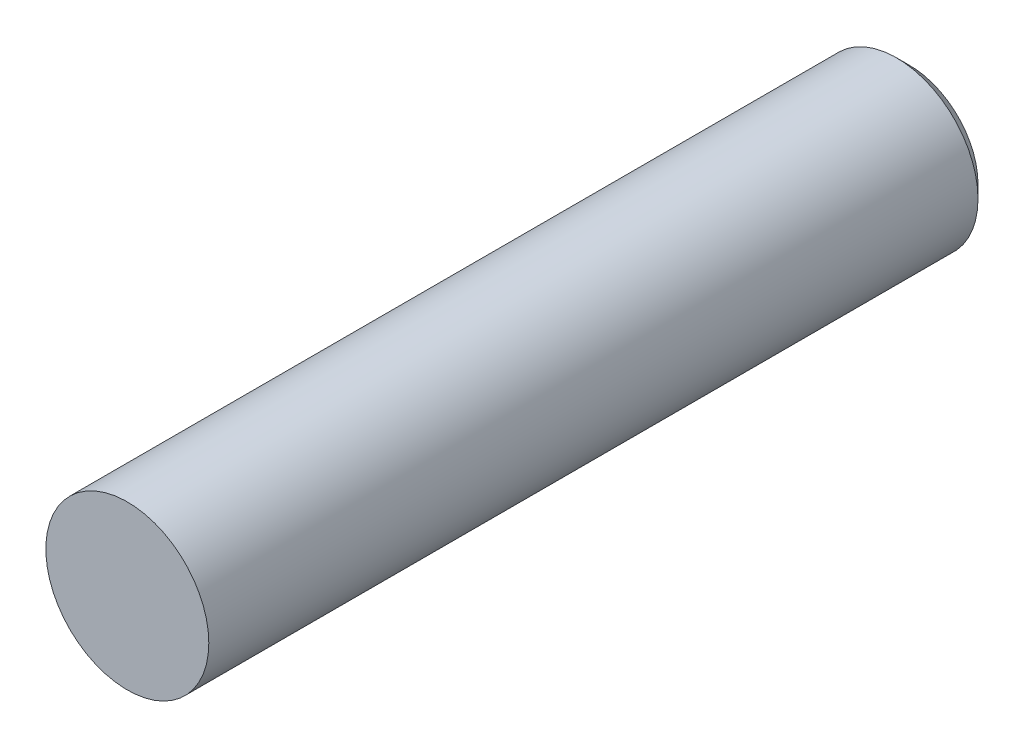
from build123d import *

# Parameters (mm, degrees)
ESQUISSE1_R          = 12.5
BASE_EXTRUSION_DEPTH = 120
CHANFREIN1_SIZE      = 2


with BuildPart() as part:
    # Esquisse1 → Base-Extrusion (new body)
    with BuildSketch(Plane.XY):
        Circle(ESQUISSE1_R)
    extrude(amount=BASE_EXTRUSION_DEPTH)

    # Chanfrein1
    chanfrein1_edges = [part.edges().sort_by_distance(p)[0] for p in [
        (-12.5, 0, 0),
    ]]
    chamfer(chanfrein1_edges, length=CHANFREIN1_SIZE)


solid = part.part
